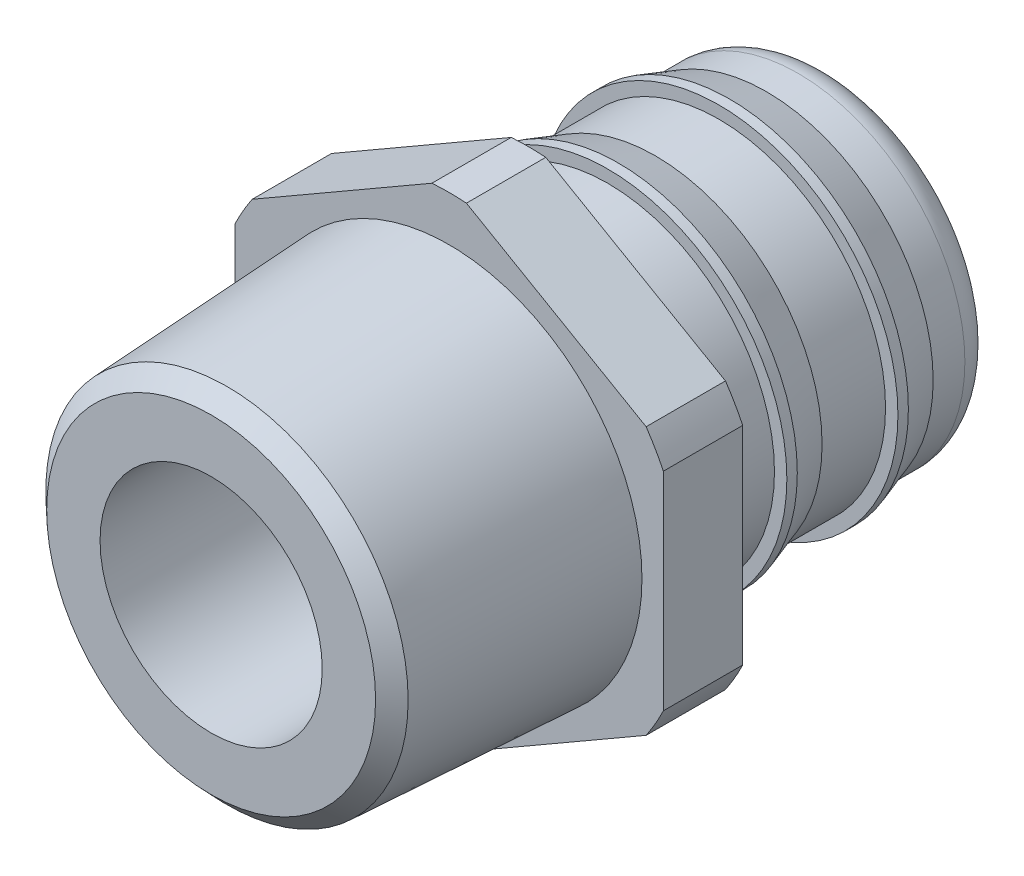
ISO-10303-21;
HEADER;
FILE_DESCRIPTION(('STEP AP214'),'2;1');
FILE_NAME('part.step','',(''),(''),'','','');
FILE_SCHEMA(('AUTOMOTIVE_DESIGN { 1 0 10303 214 1 1 1 1 }'));
ENDSEC;
DATA;
#1=APPLICATION_CONTEXT('core data for automotive mechanical design processes');
#2=APPLICATION_PROTOCOL_DEFINITION('international standard','automotive_design',2000,#1);
#3=PRODUCT_CONTEXT('',#1,'mechanical');
#4=PRODUCT('Part','Part','',(#3));
#5=PRODUCT_RELATED_PRODUCT_CATEGORY('part','',(#4));
#6=PRODUCT_DEFINITION_FORMATION('','',#4);
#7=PRODUCT_DEFINITION_CONTEXT('part definition',#1,'design');
#8=PRODUCT_DEFINITION('design','',#6,#7);
#9=PRODUCT_DEFINITION_SHAPE('','',#8);
#10=(LENGTH_UNIT() NAMED_UNIT(*) SI_UNIT(.MILLI.,.METRE.));
#11=(NAMED_UNIT(*) PLANE_ANGLE_UNIT() SI_UNIT($,.RADIAN.));
#12=(NAMED_UNIT(*) SI_UNIT($,.STERADIAN.) SOLID_ANGLE_UNIT());
#13=UNCERTAINTY_MEASURE_WITH_UNIT(LENGTH_MEASURE(1.E-05),#10,'distance_accuracy_value','');
#14=(GEOMETRIC_REPRESENTATION_CONTEXT(3) GLOBAL_UNCERTAINTY_ASSIGNED_CONTEXT((#13)) GLOBAL_UNIT_ASSIGNED_CONTEXT((#10,
#11,#12)) REPRESENTATION_CONTEXT('',''));
#15=CARTESIAN_POINT('',(0.,0.,0.));
#16=DIRECTION('',(0.,0.,1.));
#17=DIRECTION('',(1.,0.,0.));
#18=AXIS2_PLACEMENT_3D('',#15,#16,#17);
#19=CARTESIAN_POINT('',(0.,0.,0.));
#20=DIRECTION('',(0.,0.,1.));
#21=DIRECTION('',(1.,0.,0.));
#22=AXIS2_PLACEMENT_3D('',#19,#20,#21);
#23=CYLINDRICAL_SURFACE('',#22,15.);
#24=CARTESIAN_POINT('',(0.,0.,-30.));
#25=DIRECTION('',(0.,0.,1.));
#26=DIRECTION('',(1.,0.,0.));
#27=AXIS2_PLACEMENT_3D('',#24,#25,#26);
#28=CIRCLE('',#27,15.);
#29=CARTESIAN_POINT('',(-12.4123758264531,8.42216874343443,-30.));
#30=VERTEX_POINT('',#29);
#31=CARTESIAN_POINT('',(-13.5,6.53834841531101,-30.));
#32=VERTEX_POINT('',#31);
#33=EDGE_CURVE('E133',#30,#32,#28,.T.);
#34=ORIENTED_EDGE('',*,*,#33,.T.);
#35=DIRECTION('',(0.,0.,-1.));
#36=VECTOR('',#35,1.);
#37=CARTESIAN_POINT('',(-13.5,6.53834841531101,-10.));
#38=LINE('',#37,#36);
#39=CARTESIAN_POINT('',(-13.5,6.53834841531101,-25.));
#40=VERTEX_POINT('',#39);
#41=EDGE_CURVE('E118',#40,#32,#38,.T.);
#42=ORIENTED_EDGE('',*,*,#41,.F.);
#43=CARTESIAN_POINT('',(0.,0.,-25.));
#44=DIRECTION('',(0.,0.,1.));
#45=DIRECTION('',(1.,0.,0.));
#46=AXIS2_PLACEMENT_3D('',#43,#44,#45);
#47=CIRCLE('',#46,15.);
#48=CARTESIAN_POINT('',(-12.4123758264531,8.42216874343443,-25.));
#49=VERTEX_POINT('',#48);
#50=EDGE_CURVE('E155',#49,#40,#47,.T.);
#51=ORIENTED_EDGE('',*,*,#50,.F.);
#52=DIRECTION('',(0.,0.,-1.));
#53=VECTOR('',#52,1.);
#54=CARTESIAN_POINT('',(-12.4123758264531,8.42216874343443,-10.));
#55=LINE('',#54,#53);
#56=EDGE_CURVE('E138',#49,#30,#55,.T.);
#57=ORIENTED_EDGE('',*,*,#56,.T.);
#58=EDGE_LOOP('',(#34,#42,#51,#57));
#59=FACE_BOUND('',#58,.T.);
#60=ADVANCED_FACE('F31',(#59),#23,.T.);
#61=CARTESIAN_POINT('',(-13.5,-6.53834841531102,-25.));
#62=VERTEX_POINT('',#61);
#63=CARTESIAN_POINT('',(-12.4123758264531,-8.42216874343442,-25.));
#64=VERTEX_POINT('',#63);
#65=EDGE_CURVE('E156',#62,#64,#47,.T.);
#66=ORIENTED_EDGE('',*,*,#65,.F.);
#67=DIRECTION('',(0.,0.,-1.));
#68=VECTOR('',#67,1.);
#69=CARTESIAN_POINT('',(-13.5,-6.53834841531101,-10.));
#70=LINE('',#69,#68);
#71=CARTESIAN_POINT('',(-13.5,-6.53834841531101,-30.));
#72=VERTEX_POINT('',#71);
#73=EDGE_CURVE('E46',#62,#72,#70,.T.);
#74=ORIENTED_EDGE('',*,*,#73,.T.);
#75=CARTESIAN_POINT('',(-12.4123758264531,-8.42216874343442,-30.));
#76=VERTEX_POINT('',#75);
#77=EDGE_CURVE('E135',#72,#76,#28,.T.);
#78=ORIENTED_EDGE('',*,*,#77,.T.);
#79=DIRECTION('',(0.,0.,-1.));
#80=VECTOR('',#79,1.);
#81=CARTESIAN_POINT('',(-12.4123758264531,-8.42216874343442,-10.));
#82=LINE('',#81,#80);
#83=EDGE_CURVE('E215',#64,#76,#82,.T.);
#84=ORIENTED_EDGE('',*,*,#83,.F.);
#85=EDGE_LOOP('',(#66,#74,#78,#84));
#86=FACE_BOUND('',#85,.T.);
#87=ADVANCED_FACE('F222',(#86),#23,.T.);
#88=CARTESIAN_POINT('',(-1.08762417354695,-14.9605171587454,-25.));
#89=VERTEX_POINT('',#88);
#90=CARTESIAN_POINT('',(1.08762417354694,-14.9605171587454,-25.));
#91=VERTEX_POINT('',#90);
#92=EDGE_CURVE('E163',#89,#91,#47,.T.);
#93=ORIENTED_EDGE('',*,*,#92,.F.);
#94=DIRECTION('',(0.,0.,-1.));
#95=VECTOR('',#94,1.);
#96=CARTESIAN_POINT('',(-1.08762417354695,-14.9605171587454,-10.));
#97=LINE('',#96,#95);
#98=CARTESIAN_POINT('',(-1.08762417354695,-14.9605171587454,-30.));
#99=VERTEX_POINT('',#98);
#100=EDGE_CURVE('E53',#89,#99,#97,.T.);
#101=ORIENTED_EDGE('',*,*,#100,.T.);
#102=CARTESIAN_POINT('',(1.08762417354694,-14.9605171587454,-30.));
#103=VERTEX_POINT('',#102);
#104=EDGE_CURVE('E144',#99,#103,#28,.T.);
#105=ORIENTED_EDGE('',*,*,#104,.T.);
#106=DIRECTION('',(0.,0.,-1.));
#107=VECTOR('',#106,1.);
#108=CARTESIAN_POINT('',(1.08762417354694,-14.9605171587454,-10.));
#109=LINE('',#108,#107);
#110=EDGE_CURVE('E208',#91,#103,#109,.T.);
#111=ORIENTED_EDGE('',*,*,#110,.F.);
#112=EDGE_LOOP('',(#93,#101,#105,#111));
#113=FACE_BOUND('',#112,.T.);
#114=ADVANCED_FACE('F230',(#113),#23,.T.);
#115=CARTESIAN_POINT('',(12.4123758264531,-8.42216874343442,-25.));
#116=VERTEX_POINT('',#115);
#117=CARTESIAN_POINT('',(13.5,-6.53834841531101,-25.));
#118=VERTEX_POINT('',#117);
#119=EDGE_CURVE('E165',#116,#118,#47,.T.);
#120=ORIENTED_EDGE('',*,*,#119,.F.);
#121=DIRECTION('',(0.,0.,-1.));
#122=VECTOR('',#121,1.);
#123=CARTESIAN_POINT('',(12.4123758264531,-8.42216874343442,-10.));
#124=LINE('',#123,#122);
#125=CARTESIAN_POINT('',(12.4123758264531,-8.42216874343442,-30.));
#126=VERTEX_POINT('',#125);
#127=EDGE_CURVE('E207',#116,#126,#124,.T.);
#128=ORIENTED_EDGE('',*,*,#127,.T.);
#129=CARTESIAN_POINT('',(13.5,-6.53834841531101,-30.));
#130=VERTEX_POINT('',#129);
#131=EDGE_CURVE('E147',#126,#130,#28,.T.);
#132=ORIENTED_EDGE('',*,*,#131,.T.);
#133=DIRECTION('',(0.,0.,-1.));
#134=VECTOR('',#133,1.);
#135=CARTESIAN_POINT('',(13.5,-6.53834841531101,-10.));
#136=LINE('',#135,#134);
#137=EDGE_CURVE('E201',#118,#130,#136,.T.);
#138=ORIENTED_EDGE('',*,*,#137,.F.);
#139=EDGE_LOOP('',(#120,#128,#132,#138));
#140=FACE_BOUND('',#139,.T.);
#141=ADVANCED_FACE('F381',(#140),#23,.T.);
#142=CARTESIAN_POINT('',(1.08762417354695,14.9605171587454,-30.));
#143=VERTEX_POINT('',#142);
#144=CARTESIAN_POINT('',(-1.08762417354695,14.9605171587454,-30.));
#145=VERTEX_POINT('',#144);
#146=EDGE_CURVE('E139',#143,#145,#28,.T.);
#147=ORIENTED_EDGE('',*,*,#146,.T.);
#148=DIRECTION('',(0.,0.,-1.));
#149=VECTOR('',#148,1.);
#150=CARTESIAN_POINT('',(-1.08762417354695,14.9605171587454,-10.));
#151=LINE('',#150,#149);
#152=CARTESIAN_POINT('',(-1.08762417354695,14.9605171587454,-25.));
#153=VERTEX_POINT('',#152);
#154=EDGE_CURVE('E195',#153,#145,#151,.T.);
#155=ORIENTED_EDGE('',*,*,#154,.F.);
#156=CARTESIAN_POINT('',(1.08762417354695,14.9605171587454,-25.));
#157=VERTEX_POINT('',#156);
#158=EDGE_CURVE('E148',#157,#153,#47,.T.);
#159=ORIENTED_EDGE('',*,*,#158,.F.);
#160=DIRECTION('',(0.,0.,-1.));
#161=VECTOR('',#160,1.);
#162=CARTESIAN_POINT('',(1.08762417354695,14.9605171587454,-10.));
#163=LINE('',#162,#161);
#164=EDGE_CURVE('E188',#157,#143,#163,.T.);
#165=ORIENTED_EDGE('',*,*,#164,.T.);
#166=EDGE_LOOP('',(#147,#155,#159,#165));
#167=FACE_BOUND('',#166,.T.);
#168=ADVANCED_FACE('F344',(#167),#23,.T.);
#169=CARTESIAN_POINT('',(0.,0.,0.));
#170=DIRECTION('',(0.,0.,1.));
#171=DIRECTION('',(1.,0.,0.));
#172=AXIS2_PLACEMENT_3D('',#169,#170,#171);
#173=CYLINDRICAL_SURFACE('',#172,7.);
#174=CARTESIAN_POINT('',(0.,0.,-49.));
#175=DIRECTION('',(0.,0.,1.));
#176=DIRECTION('',(1.,0.,0.));
#177=AXIS2_PLACEMENT_3D('',#174,#175,#176);
#178=CIRCLE('',#177,7.);
#179=CARTESIAN_POINT('',(7.,0.,-49.));
#180=VERTEX_POINT('',#179);
#181=EDGE_CURVE('E242',#180,#180,#178,.T.);
#182=ORIENTED_EDGE('',*,*,#181,.F.);
#183=EDGE_LOOP('',(#182));
#184=FACE_BOUND('',#183,.T.);
#185=CARTESIAN_POINT('',(0.,0.,-10.));
#186=DIRECTION('',(0.,0.,1.));
#187=DIRECTION('',(1.,0.,0.));
#188=AXIS2_PLACEMENT_3D('',#185,#186,#187);
#189=CIRCLE('',#188,7.);
#190=CARTESIAN_POINT('',(7.,0.,-10.));
#191=VERTEX_POINT('',#190);
#192=EDGE_CURVE('E185',#191,#191,#189,.T.);
#193=ORIENTED_EDGE('',*,*,#192,.T.);
#194=EDGE_LOOP('',(#193));
#195=FACE_BOUND('',#194,.T.);
#196=ADVANCED_FACE('F33',(#184,#195),#173,.F.);
#197=CARTESIAN_POINT('',(0.,8.49999999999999,-49.));
#198=DIRECTION('',(0.,0.,1.));
#199=DIRECTION('',(1.,0.,0.));
#200=AXIS2_PLACEMENT_3D('',#197,#198,#199);
#201=PLANE('',#200);
#202=CARTESIAN_POINT('',(0.,0.,-49.));
#203=DIRECTION('',(0.,0.,1.));
#204=DIRECTION('',(1.,0.,0.));
#205=AXIS2_PLACEMENT_3D('',#202,#203,#204);
#206=CIRCLE('',#205,8.49999999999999);
#207=CARTESIAN_POINT('',(8.49999999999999,0.,-49.));
#208=VERTEX_POINT('',#207);
#209=EDGE_CURVE('E245',#208,#208,#206,.T.);
#210=ORIENTED_EDGE('',*,*,#209,.F.);
#211=EDGE_LOOP('',(#210));
#212=FACE_BOUND('',#211,.T.);
#213=ORIENTED_EDGE('',*,*,#181,.T.);
#214=EDGE_LOOP('',(#213));
#215=FACE_BOUND('',#214,.T.);
#216=ADVANCED_FACE('F334',(#212,#215),#201,.F.);
#217=CARTESIAN_POINT('',(0.,0.,-47.));
#218=DIRECTION('',(0.,0.,1.));
#219=DIRECTION('',(1.,0.,0.));
#220=AXIS2_PLACEMENT_3D('',#217,#218,#219);
#221=TOROIDAL_SURFACE('',#220,8.5,2.);
#222=CARTESIAN_POINT('',(0.,0.,-47.));
#223=DIRECTION('',(0.,0.,1.));
#224=DIRECTION('',(1.,0.,0.));
#225=AXIS2_PLACEMENT_3D('',#222,#223,#224);
#226=CIRCLE('',#225,10.5);
#227=CARTESIAN_POINT('',(10.5,0.,-47.));
#228=VERTEX_POINT('',#227);
#229=EDGE_CURVE('E248',#228,#228,#226,.T.);
#230=ORIENTED_EDGE('',*,*,#229,.F.);
#231=EDGE_LOOP('',(#230));
#232=FACE_BOUND('',#231,.T.);
#233=ORIENTED_EDGE('',*,*,#209,.T.);
#234=EDGE_LOOP('',(#233));
#235=FACE_BOUND('',#234,.T.);
#236=ADVANCED_FACE('F328',(#232,#235),#221,.T.);
#237=CARTESIAN_POINT('',(0.,0.,0.));
#238=DIRECTION('',(0.,0.,1.));
#239=DIRECTION('',(1.,0.,0.));
#240=AXIS2_PLACEMENT_3D('',#237,#238,#239);
#241=CYLINDRICAL_SURFACE('',#240,10.5);
#242=CARTESIAN_POINT('',(0.,0.,-45.00000000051));
#243=DIRECTION('',(0.,0.,1.));
#244=DIRECTION('',(1.,0.,0.));
#245=AXIS2_PLACEMENT_3D('',#242,#243,#244);
#246=CIRCLE('',#245,10.5);
#247=CARTESIAN_POINT('',(10.5,0.,-45.00000000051));
#248=VERTEX_POINT('',#247);
#249=EDGE_CURVE('E251',#248,#248,#246,.T.);
#250=ORIENTED_EDGE('',*,*,#249,.F.);
#251=EDGE_LOOP('',(#250));
#252=FACE_BOUND('',#251,.T.);
#253=ORIENTED_EDGE('',*,*,#229,.T.);
#254=EDGE_LOOP('',(#253));
#255=FACE_BOUND('',#254,.T.);
#256=ADVANCED_FACE('F322',(#252,#255),#241,.T.);
#257=CARTESIAN_POINT('',(0.,0.,-45.00000000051));
#258=DIRECTION('',(0.,0.,1.));
#259=DIRECTION('',(1.,0.,0.));
#260=AXIS2_PLACEMENT_3D('',#257,#258,#259);
#261=CONICAL_SURFACE('',#260,10.5,0.32175055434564);
#262=CARTESIAN_POINT('',(0.,0.,-42.6581138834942));
#263=DIRECTION('',(0.,0.,1.));
#264=DIRECTION('',(1.,0.,0.));
#265=AXIS2_PLACEMENT_3D('',#262,#263,#264);
#266=CIRCLE('',#265,11.2806287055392);
#267=CARTESIAN_POINT('',(11.2806287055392,0.,-42.6581138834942));
#268=VERTEX_POINT('',#267);
#269=EDGE_CURVE('E254',#268,#268,#266,.T.);
#270=ORIENTED_EDGE('',*,*,#269,.F.);
#271=EDGE_LOOP('',(#270));
#272=FACE_BOUND('',#271,.T.);
#273=ORIENTED_EDGE('',*,*,#249,.T.);
#274=EDGE_LOOP('',(#273));
#275=FACE_BOUND('',#274,.T.);
#276=ADVANCED_FACE('F316',(#272,#275),#261,.T.);
#277=CARTESIAN_POINT('',(0.,0.,0.));
#278=DIRECTION('',(0.,0.,1.));
#279=DIRECTION('',(1.,0.,0.));
#280=AXIS2_PLACEMENT_3D('',#277,#278,#279);
#281=CYLINDRICAL_SURFACE('',#280,11.2806287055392);
#282=CARTESIAN_POINT('',(0.,0.,-42.));
#283=DIRECTION('',(0.,0.,1.));
#284=DIRECTION('',(1.,0.,0.));
#285=AXIS2_PLACEMENT_3D('',#282,#283,#284);
#286=CIRCLE('',#285,11.2806287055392);
#287=CARTESIAN_POINT('',(11.2806287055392,0.,-42.));
#288=VERTEX_POINT('',#287);
#289=EDGE_CURVE('E257',#288,#288,#286,.T.);
#290=ORIENTED_EDGE('',*,*,#289,.F.);
#291=EDGE_LOOP('',(#290));
#292=FACE_BOUND('',#291,.T.);
#293=ORIENTED_EDGE('',*,*,#269,.T.);
#294=EDGE_LOOP('',(#293));
#295=FACE_BOUND('',#294,.T.);
#296=ADVANCED_FACE('F310',(#292,#295),#281,.T.);
#297=CARTESIAN_POINT('',(0.,10.5,-42.));
#298=DIRECTION('',(0.,0.,-1.));
#299=DIRECTION('',(-1.,0.,0.));
#300=AXIS2_PLACEMENT_3D('',#297,#298,#299);
#301=PLANE('',#300);
#302=CARTESIAN_POINT('',(0.,0.,-42.));
#303=DIRECTION('',(0.,0.,1.));
#304=DIRECTION('',(1.,0.,0.));
#305=AXIS2_PLACEMENT_3D('',#302,#303,#304);
#306=CIRCLE('',#305,10.5);
#307=CARTESIAN_POINT('',(10.5,0.,-42.));
#308=VERTEX_POINT('',#307);
#309=EDGE_CURVE('E260',#308,#308,#306,.T.);
#310=ORIENTED_EDGE('',*,*,#309,.F.);
#311=EDGE_LOOP('',(#310));
#312=FACE_BOUND('',#311,.T.);
#313=ORIENTED_EDGE('',*,*,#289,.T.);
#314=EDGE_LOOP('',(#313));
#315=FACE_BOUND('',#314,.T.);
#316=ADVANCED_FACE('F304',(#312,#315),#301,.F.);
#317=CARTESIAN_POINT('',(0.,0.,0.));
#318=DIRECTION('',(0.,0.,1.));
#319=DIRECTION('',(1.,0.,0.));
#320=AXIS2_PLACEMENT_3D('',#317,#318,#319);
#321=CYLINDRICAL_SURFACE('',#320,10.5);
#322=CARTESIAN_POINT('',(0.,0.,-38.));
#323=DIRECTION('',(0.,0.,1.));
#324=DIRECTION('',(1.,0.,0.));
#325=AXIS2_PLACEMENT_3D('',#322,#323,#324);
#326=CIRCLE('',#325,10.5);
#327=CARTESIAN_POINT('',(10.5,0.,-38.));
#328=VERTEX_POINT('',#327);
#329=EDGE_CURVE('E263',#328,#328,#326,.T.);
#330=ORIENTED_EDGE('',*,*,#329,.F.);
#331=EDGE_LOOP('',(#330));
#332=FACE_BOUND('',#331,.T.);
#333=ORIENTED_EDGE('',*,*,#309,.T.);
#334=EDGE_LOOP('',(#333));
#335=FACE_BOUND('',#334,.T.);
#336=ADVANCED_FACE('F298',(#332,#335),#321,.T.);
#337=CARTESIAN_POINT('',(0.,0.,-38.));
#338=DIRECTION('',(0.,0.,1.));
#339=DIRECTION('',(1.,0.,0.));
#340=AXIS2_PLACEMENT_3D('',#337,#338,#339);
#341=CONICAL_SURFACE('',#340,10.5,0.321750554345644);
#342=CARTESIAN_POINT('',(0.,0.,-35.6581138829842));
#343=DIRECTION('',(0.,0.,1.));
#344=DIRECTION('',(1.,0.,0.));
#345=AXIS2_PLACEMENT_3D('',#342,#343,#344);
#346=CIRCLE('',#345,11.2806287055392);
#347=CARTESIAN_POINT('',(11.2806287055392,0.,-35.6581138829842));
#348=VERTEX_POINT('',#347);
#349=EDGE_CURVE('E266',#348,#348,#346,.T.);
#350=ORIENTED_EDGE('',*,*,#349,.F.);
#351=EDGE_LOOP('',(#350));
#352=FACE_BOUND('',#351,.T.);
#353=ORIENTED_EDGE('',*,*,#329,.T.);
#354=EDGE_LOOP('',(#353));
#355=FACE_BOUND('',#354,.T.);
#356=ADVANCED_FACE('F292',(#352,#355),#341,.T.);
#357=CARTESIAN_POINT('',(0.,0.,0.));
#358=DIRECTION('',(0.,0.,1.));
#359=DIRECTION('',(1.,0.,0.));
#360=AXIS2_PLACEMENT_3D('',#357,#358,#359);
#361=CYLINDRICAL_SURFACE('',#360,11.2806287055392);
#362=CARTESIAN_POINT('',(0.,0.,-35.));
#363=DIRECTION('',(0.,0.,1.));
#364=DIRECTION('',(1.,0.,0.));
#365=AXIS2_PLACEMENT_3D('',#362,#363,#364);
#366=CIRCLE('',#365,11.2806287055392);
#367=CARTESIAN_POINT('',(11.2806287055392,0.,-35.));
#368=VERTEX_POINT('',#367);
#369=EDGE_CURVE('E269',#368,#368,#366,.T.);
#370=ORIENTED_EDGE('',*,*,#369,.F.);
#371=EDGE_LOOP('',(#370));
#372=FACE_BOUND('',#371,.T.);
#373=ORIENTED_EDGE('',*,*,#349,.T.);
#374=EDGE_LOOP('',(#373));
#375=FACE_BOUND('',#374,.T.);
#376=ADVANCED_FACE('F286',(#372,#375),#361,.T.);
#377=CARTESIAN_POINT('',(0.,10.5,-35.));
#378=DIRECTION('',(0.,0.,-1.));
#379=DIRECTION('',(-1.,0.,0.));
#380=AXIS2_PLACEMENT_3D('',#377,#378,#379);
#381=PLANE('',#380);
#382=CARTESIAN_POINT('',(0.,0.,-35.));
#383=DIRECTION('',(0.,0.,1.));
#384=DIRECTION('',(1.,0.,0.));
#385=AXIS2_PLACEMENT_3D('',#382,#383,#384);
#386=CIRCLE('',#385,10.5);
#387=CARTESIAN_POINT('',(10.5,0.,-35.));
#388=VERTEX_POINT('',#387);
#389=EDGE_CURVE('E272',#388,#388,#386,.T.);
#390=ORIENTED_EDGE('',*,*,#389,.F.);
#391=EDGE_LOOP('',(#390));
#392=FACE_BOUND('',#391,.T.);
#393=ORIENTED_EDGE('',*,*,#369,.T.);
#394=EDGE_LOOP('',(#393));
#395=FACE_BOUND('',#394,.T.);
#396=ADVANCED_FACE('F280',(#392,#395),#381,.F.);
#397=CARTESIAN_POINT('',(0.,0.,0.));
#398=DIRECTION('',(0.,0.,1.));
#399=DIRECTION('',(1.,0.,0.));
#400=AXIS2_PLACEMENT_3D('',#397,#398,#399);
#401=CYLINDRICAL_SURFACE('',#400,10.5);
#402=CARTESIAN_POINT('',(0.,0.,-30.));
#403=DIRECTION('',(0.,0.,1.));
#404=DIRECTION('',(1.,0.,0.));
#405=AXIS2_PLACEMENT_3D('',#402,#403,#404);
#406=CIRCLE('',#405,10.5);
#407=CARTESIAN_POINT('',(10.5,0.,-30.));
#408=VERTEX_POINT('',#407);
#409=EDGE_CURVE('E143',#408,#408,#406,.T.);
#410=ORIENTED_EDGE('',*,*,#409,.F.);
#411=EDGE_LOOP('',(#410));
#412=FACE_BOUND('',#411,.T.);
#413=ORIENTED_EDGE('',*,*,#389,.T.);
#414=EDGE_LOOP('',(#413));
#415=FACE_BOUND('',#414,.T.);
#416=ADVANCED_FACE('F277',(#412,#415),#401,.T.);
#417=CARTESIAN_POINT('',(0.,15.,-30.));
#418=DIRECTION('',(0.,0.,1.));
#419=DIRECTION('',(1.,0.,0.));
#420=AXIS2_PLACEMENT_3D('',#417,#418,#419);
#421=PLANE('',#420);
#422=ORIENTED_EDGE('',*,*,#77,.F.);
#423=DIRECTION('',(0.,-1.,0.));
#424=VECTOR('',#423,1.);
#425=CARTESIAN_POINT('',(-13.5,-6.53834841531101,-30.));
#426=LINE('',#425,#424);
#427=EDGE_CURVE('E121',#32,#72,#426,.T.);
#428=ORIENTED_EDGE('',*,*,#427,.F.);
#429=ORIENTED_EDGE('',*,*,#33,.F.);
#430=DIRECTION('',(-0.866025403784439,-0.5,0.));
#431=VECTOR('',#430,1.);
#432=CARTESIAN_POINT('',(-12.4123758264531,8.42216874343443,-30.));
#433=LINE('',#432,#431);
#434=EDGE_CURVE('E197',#145,#30,#433,.T.);
#435=ORIENTED_EDGE('',*,*,#434,.F.);
#436=ORIENTED_EDGE('',*,*,#146,.F.);
#437=DIRECTION('',(-0.866025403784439,0.5,0.));
#438=VECTOR('',#437,1.);
#439=CARTESIAN_POINT('',(1.08762417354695,14.9605171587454,-30.));
#440=LINE('',#439,#438);
#441=CARTESIAN_POINT('',(12.4123758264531,8.42216874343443,-30.));
#442=VERTEX_POINT('',#441);
#443=EDGE_CURVE('E191',#442,#143,#440,.T.);
#444=ORIENTED_EDGE('',*,*,#443,.F.);
#445=CARTESIAN_POINT('',(13.5,6.53834841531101,-30.));
#446=VERTEX_POINT('',#445);
#447=EDGE_CURVE('E141',#446,#442,#28,.T.);
#448=ORIENTED_EDGE('',*,*,#447,.F.);
#449=DIRECTION('',(0.,1.,0.));
#450=VECTOR('',#449,1.);
#451=CARTESIAN_POINT('',(13.5,6.53834841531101,-30.));
#452=LINE('',#451,#450);
#453=EDGE_CURVE('E204',#130,#446,#452,.T.);
#454=ORIENTED_EDGE('',*,*,#453,.F.);
#455=ORIENTED_EDGE('',*,*,#131,.F.);
#456=DIRECTION('',(0.866025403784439,0.5,0.));
#457=VECTOR('',#456,1.);
#458=CARTESIAN_POINT('',(12.4123758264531,-8.42216874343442,-30.));
#459=LINE('',#458,#457);
#460=EDGE_CURVE('E211',#103,#126,#459,.T.);
#461=ORIENTED_EDGE('',*,*,#460,.F.);
#462=ORIENTED_EDGE('',*,*,#104,.F.);
#463=DIRECTION('',(0.866025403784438,-0.5,0.));
#464=VECTOR('',#463,1.);
#465=CARTESIAN_POINT('',(-1.08762417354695,-14.9605171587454,-30.));
#466=LINE('',#465,#464);
#467=EDGE_CURVE('E218',#76,#99,#466,.T.);
#468=ORIENTED_EDGE('',*,*,#467,.F.);
#469=EDGE_LOOP('',(#422,#428,#429,#435,#436,#444,#448,#454,#455,#461,#462,#468));
#470=FACE_BOUND('',#469,.T.);
#471=ORIENTED_EDGE('',*,*,#409,.T.);
#472=EDGE_LOOP('',(#471));
#473=FACE_BOUND('',#472,.T.);
#474=ADVANCED_FACE('F130',(#470,#473),#421,.F.);
#475=CARTESIAN_POINT('',(13.5,6.53834841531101,-25.));
#476=VERTEX_POINT('',#475);
#477=CARTESIAN_POINT('',(12.4123758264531,8.42216874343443,-25.));
#478=VERTEX_POINT('',#477);
#479=EDGE_CURVE('E161',#476,#478,#47,.T.);
#480=ORIENTED_EDGE('',*,*,#479,.F.);
#481=DIRECTION('',(0.,0.,-1.));
#482=VECTOR('',#481,1.);
#483=CARTESIAN_POINT('',(13.5,6.53834841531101,-10.));
#484=LINE('',#483,#482);
#485=EDGE_CURVE('E200',#476,#446,#484,.T.);
#486=ORIENTED_EDGE('',*,*,#485,.T.);
#487=ORIENTED_EDGE('',*,*,#447,.T.);
#488=DIRECTION('',(0.,0.,-1.));
#489=VECTOR('',#488,1.);
#490=CARTESIAN_POINT('',(12.4123758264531,8.42216874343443,-10.));
#491=LINE('',#490,#489);
#492=EDGE_CURVE('E189',#478,#442,#491,.T.);
#493=ORIENTED_EDGE('',*,*,#492,.F.);
#494=EDGE_LOOP('',(#480,#486,#487,#493));
#495=FACE_BOUND('',#494,.T.);
#496=ADVANCED_FACE('F367',(#495),#23,.T.);
#497=CARTESIAN_POINT('',(0.,12.15,-25.));
#498=DIRECTION('',(0.,0.,-1.));
#499=DIRECTION('',(-1.,0.,0.));
#500=AXIS2_PLACEMENT_3D('',#497,#498,#499);
#501=PLANE('',#500);
#502=CARTESIAN_POINT('',(0.,0.,-25.));
#503=DIRECTION('',(0.,0.,1.));
#504=DIRECTION('',(1.,0.,0.));
#505=AXIS2_PLACEMENT_3D('',#502,#503,#504);
#506=CIRCLE('',#505,12.15);
#507=CARTESIAN_POINT('',(12.15,0.,-25.));
#508=VERTEX_POINT('',#507);
#509=EDGE_CURVE('E172',#508,#508,#506,.T.);
#510=ORIENTED_EDGE('',*,*,#509,.F.);
#511=EDGE_LOOP('',(#510));
#512=FACE_BOUND('',#511,.T.);
#513=ORIENTED_EDGE('',*,*,#50,.T.);
#514=DIRECTION('',(0.,-1.,0.));
#515=VECTOR('',#514,1.);
#516=CARTESIAN_POINT('',(-13.5,12.15,-25.));
#517=LINE('',#516,#515);
#518=EDGE_CURVE('E11',#40,#62,#517,.T.);
#519=ORIENTED_EDGE('',*,*,#518,.T.);
#520=ORIENTED_EDGE('',*,*,#65,.T.);
#521=DIRECTION('',(0.866025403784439,-0.5,0.));
#522=VECTOR('',#521,1.);
#523=CARTESIAN_POINT('',(-12.0111043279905,-8.65384295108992,-25.));
#524=LINE('',#523,#522);
#525=EDGE_CURVE('E39',#64,#89,#524,.T.);
#526=ORIENTED_EDGE('',*,*,#525,.T.);
#527=ORIENTED_EDGE('',*,*,#92,.T.);
#528=DIRECTION('',(0.866025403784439,0.5,0.));
#529=VECTOR('',#528,1.);
#530=CARTESIAN_POINT('',(12.0111043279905,-8.65384295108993,-25.));
#531=LINE('',#530,#529);
#532=EDGE_CURVE('E233',#91,#116,#531,.T.);
#533=ORIENTED_EDGE('',*,*,#532,.T.);
#534=ORIENTED_EDGE('',*,*,#119,.T.);
#535=DIRECTION('',(0.,1.,0.));
#536=VECTOR('',#535,1.);
#537=CARTESIAN_POINT('',(13.5,12.15,-25.));
#538=LINE('',#537,#536);
#539=EDGE_CURVE('E234',#118,#476,#538,.T.);
#540=ORIENTED_EDGE('',*,*,#539,.T.);
#541=ORIENTED_EDGE('',*,*,#479,.T.);
#542=DIRECTION('',(-0.866025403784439,0.5,0.));
#543=VECTOR('',#542,1.);
#544=CARTESIAN_POINT('',(1.48889567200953,14.7288429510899,-25.));
#545=LINE('',#544,#543);
#546=EDGE_CURVE('E240',#478,#157,#545,.T.);
#547=ORIENTED_EDGE('',*,*,#546,.T.);
#548=ORIENTED_EDGE('',*,*,#158,.T.);
#549=DIRECTION('',(-0.866025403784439,-0.5,0.));
#550=VECTOR('',#549,1.);
#551=CARTESIAN_POINT('',(-1.48889567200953,14.7288429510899,-25.));
#552=LINE('',#551,#550);
#553=EDGE_CURVE('E236',#153,#49,#552,.T.);
#554=ORIENTED_EDGE('',*,*,#553,.T.);
#555=EDGE_LOOP('',(#513,#519,#520,#526,#527,#533,#534,#540,#541,#547,#548,#554));
#556=FACE_BOUND('',#555,.T.);
#557=ADVANCED_FACE('F362',(#512,#556),#501,.F.);
#558=CARTESIAN_POINT('',(0.,0.,-25.));
#559=DIRECTION('',(0.,0.,-1.));
#560=DIRECTION('',(-1.,0.,0.));
#561=AXIS2_PLACEMENT_3D('',#558,#559,#560);
#562=CONICAL_SURFACE('',#561,12.15,0.0523598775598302);
#563=CARTESIAN_POINT('',(0.,0.,-10.9986295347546));
#564=DIRECTION('',(0.,0.,1.));
#565=DIRECTION('',(1.,0.,0.));
#566=AXIS2_PLACEMENT_3D('',#563,#564,#565);
#567=CIRCLE('',#566,11.4162192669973);
#568=CARTESIAN_POINT('',(11.4162192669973,0.,-10.9986295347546));
#569=VERTEX_POINT('',#568);
#570=EDGE_CURVE('E176',#569,#569,#567,.T.);
#571=ORIENTED_EDGE('',*,*,#570,.F.);
#572=EDGE_LOOP('',(#571));
#573=FACE_BOUND('',#572,.T.);
#574=ORIENTED_EDGE('',*,*,#509,.T.);
#575=EDGE_LOOP('',(#574));
#576=FACE_BOUND('',#575,.T.);
#577=ADVANCED_FACE('F357',(#573,#576),#562,.T.);
#578=CARTESIAN_POINT('',(0.,0.,-10.9986295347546));
#579=DIRECTION('',(0.,0.,-1.));
#580=DIRECTION('',(-1.,0.,0.));
#581=AXIS2_PLACEMENT_3D('',#578,#579,#580);
#582=CONICAL_SURFACE('',#581,11.4162192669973,0.811578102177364);
#583=CARTESIAN_POINT('',(0.,0.,-10.));
#584=DIRECTION('',(0.,0.,1.));
#585=DIRECTION('',(1.,0.,0.));
#586=AXIS2_PLACEMENT_3D('',#583,#584,#585);
#587=CIRCLE('',#586,10.3638833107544);
#588=CARTESIAN_POINT('',(10.3638833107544,0.,-10.));
#589=VERTEX_POINT('',#588);
#590=EDGE_CURVE('E180',#589,#589,#587,.T.);
#591=ORIENTED_EDGE('',*,*,#590,.F.);
#592=EDGE_LOOP('',(#591));
#593=FACE_BOUND('',#592,.T.);
#594=ORIENTED_EDGE('',*,*,#570,.T.);
#595=EDGE_LOOP('',(#594));
#596=FACE_BOUND('',#595,.T.);
#597=ADVANCED_FACE('F351',(#593,#596),#582,.T.);
#598=CARTESIAN_POINT('',(0.,7.,-10.));
#599=DIRECTION('',(0.,0.,-1.));
#600=DIRECTION('',(-1.,0.,0.));
#601=AXIS2_PLACEMENT_3D('',#598,#599,#600);
#602=PLANE('',#601);
#603=ORIENTED_EDGE('',*,*,#192,.F.);
#604=EDGE_LOOP('',(#603));
#605=FACE_BOUND('',#604,.T.);
#606=ORIENTED_EDGE('',*,*,#590,.T.);
#607=EDGE_LOOP('',(#606));
#608=FACE_BOUND('',#607,.T.);
#609=ADVANCED_FACE('F347',(#605,#608),#602,.F.);
#610=CARTESIAN_POINT('',(1.08762417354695,14.9605171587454,-10.));
#611=DIRECTION('',(-0.5,-0.866025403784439,0.));
#612=DIRECTION('',(0.866025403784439,-0.5,0.));
#613=AXIS2_PLACEMENT_3D('',#610,#611,#612);
#614=PLANE('',#613);
#615=ORIENTED_EDGE('',*,*,#492,.T.);
#616=ORIENTED_EDGE('',*,*,#443,.T.);
#617=ORIENTED_EDGE('',*,*,#164,.F.);
#618=ORIENTED_EDGE('',*,*,#546,.F.);
#619=EDGE_LOOP('',(#615,#616,#617,#618));
#620=FACE_BOUND('',#619,.T.);
#621=ADVANCED_FACE('F350',(#620),#614,.F.);
#622=CARTESIAN_POINT('',(-12.4123758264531,8.42216874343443,-10.));
#623=DIRECTION('',(0.5,-0.866025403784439,0.));
#624=DIRECTION('',(0.866025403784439,0.5,0.));
#625=AXIS2_PLACEMENT_3D('',#622,#623,#624);
#626=PLANE('',#625);
#627=ORIENTED_EDGE('',*,*,#154,.T.);
#628=ORIENTED_EDGE('',*,*,#434,.T.);
#629=ORIENTED_EDGE('',*,*,#56,.F.);
#630=ORIENTED_EDGE('',*,*,#553,.F.);
#631=EDGE_LOOP('',(#627,#628,#629,#630));
#632=FACE_BOUND('',#631,.T.);
#633=ADVANCED_FACE('F391',(#632),#626,.F.);
#634=CARTESIAN_POINT('',(13.5,6.53834841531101,-10.));
#635=DIRECTION('',(-1.,0.,0.));
#636=DIRECTION('',(0.,0.,1.));
#637=AXIS2_PLACEMENT_3D('',#634,#635,#636);
#638=PLANE('',#637);
#639=ORIENTED_EDGE('',*,*,#137,.T.);
#640=ORIENTED_EDGE('',*,*,#453,.T.);
#641=ORIENTED_EDGE('',*,*,#485,.F.);
#642=ORIENTED_EDGE('',*,*,#539,.F.);
#643=EDGE_LOOP('',(#639,#640,#641,#642));
#644=FACE_BOUND('',#643,.T.);
#645=ADVANCED_FACE('F393',(#644),#638,.F.);
#646=CARTESIAN_POINT('',(12.4123758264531,-8.42216874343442,-10.));
#647=DIRECTION('',(-0.5,0.866025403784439,0.));
#648=DIRECTION('',(-0.866025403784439,-0.5,0.));
#649=AXIS2_PLACEMENT_3D('',#646,#647,#648);
#650=PLANE('',#649);
#651=ORIENTED_EDGE('',*,*,#110,.T.);
#652=ORIENTED_EDGE('',*,*,#460,.T.);
#653=ORIENTED_EDGE('',*,*,#127,.F.);
#654=ORIENTED_EDGE('',*,*,#532,.F.);
#655=EDGE_LOOP('',(#651,#652,#653,#654));
#656=FACE_BOUND('',#655,.T.);
#657=ADVANCED_FACE('F232',(#656),#650,.F.);
#658=CARTESIAN_POINT('',(-1.08762417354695,-14.9605171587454,-10.));
#659=DIRECTION('',(0.5,0.866025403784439,0.));
#660=DIRECTION('',(-0.866025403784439,0.5,0.));
#661=AXIS2_PLACEMENT_3D('',#658,#659,#660);
#662=PLANE('',#661);
#663=ORIENTED_EDGE('',*,*,#83,.T.);
#664=ORIENTED_EDGE('',*,*,#467,.T.);
#665=ORIENTED_EDGE('',*,*,#100,.F.);
#666=ORIENTED_EDGE('',*,*,#525,.F.);
#667=EDGE_LOOP('',(#663,#664,#665,#666));
#668=FACE_BOUND('',#667,.T.);
#669=ADVANCED_FACE('F224',(#668),#662,.F.);
#670=CARTESIAN_POINT('',(-13.5,-6.53834841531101,-10.));
#671=DIRECTION('',(1.,0.,0.));
#672=DIRECTION('',(0.,1.,0.));
#673=AXIS2_PLACEMENT_3D('',#670,#671,#672);
#674=PLANE('',#673);
#675=ORIENTED_EDGE('',*,*,#41,.T.);
#676=ORIENTED_EDGE('',*,*,#427,.T.);
#677=ORIENTED_EDGE('',*,*,#73,.F.);
#678=ORIENTED_EDGE('',*,*,#518,.F.);
#679=EDGE_LOOP('',(#675,#676,#677,#678));
#680=FACE_BOUND('',#679,.T.);
#681=ADVANCED_FACE('F120',(#680),#674,.F.);
#682=CLOSED_SHELL('',(#60,#87,#114,#141,#168,#196,#216,#236,#256,#276,#296,#316,#336,#356,#376,
#396,#416,#474,#496,#557,#577,#597,#609,#621,#633,#645,#657,#669,#681));
#683=MANIFOLD_SOLID_BREP('B2',#682);
#684=ADVANCED_BREP_SHAPE_REPRESENTATION('',(#18,#683),#14);
#685=SHAPE_DEFINITION_REPRESENTATION(#9,#684);
ENDSEC;
END-ISO-10303-21;
